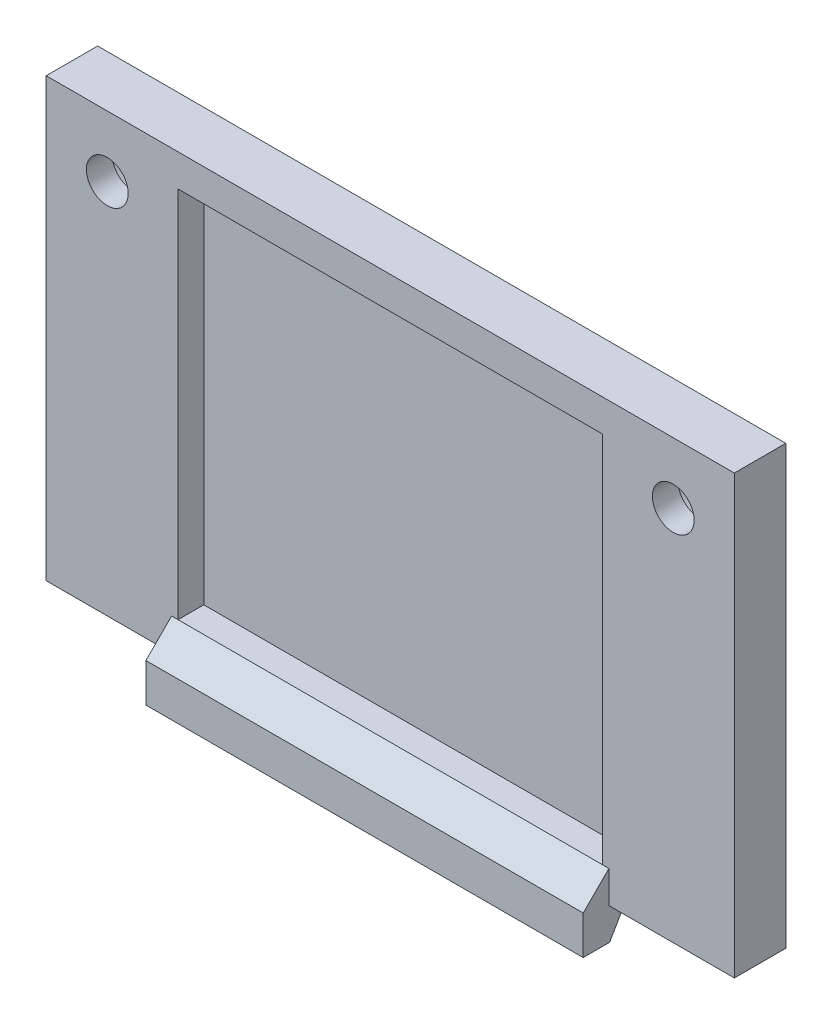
ISO-10303-21;
HEADER;
FILE_DESCRIPTION(('STEP AP214'),'2;1');
FILE_NAME('part.step','',(''),(''),'','','');
FILE_SCHEMA(('AUTOMOTIVE_DESIGN { 1 0 10303 214 1 1 1 1 }'));
ENDSEC;
DATA;
#1=APPLICATION_CONTEXT('core data for automotive mechanical design processes');
#2=APPLICATION_PROTOCOL_DEFINITION('international standard','automotive_design',2000,#1);
#3=PRODUCT_CONTEXT('',#1,'mechanical');
#4=PRODUCT('Part','Part','',(#3));
#5=PRODUCT_RELATED_PRODUCT_CATEGORY('part','',(#4));
#6=PRODUCT_DEFINITION_FORMATION('','',#4);
#7=PRODUCT_DEFINITION_CONTEXT('part definition',#1,'design');
#8=PRODUCT_DEFINITION('design','',#6,#7);
#9=PRODUCT_DEFINITION_SHAPE('','',#8);
#10=(LENGTH_UNIT() NAMED_UNIT(*) SI_UNIT(.MILLI.,.METRE.));
#11=(NAMED_UNIT(*) PLANE_ANGLE_UNIT() SI_UNIT($,.RADIAN.));
#12=(NAMED_UNIT(*) SI_UNIT($,.STERADIAN.) SOLID_ANGLE_UNIT());
#13=UNCERTAINTY_MEASURE_WITH_UNIT(LENGTH_MEASURE(1.E-05),#10,'distance_accuracy_value','');
#14=(GEOMETRIC_REPRESENTATION_CONTEXT(3) GLOBAL_UNCERTAINTY_ASSIGNED_CONTEXT((#13)) GLOBAL_UNIT_ASSIGNED_CONTEXT((#10,
#11,#12)) REPRESENTATION_CONTEXT('',''));
#15=CARTESIAN_POINT('',(0.,0.,0.));
#16=DIRECTION('',(0.,0.,1.));
#17=DIRECTION('',(1.,0.,0.));
#18=AXIS2_PLACEMENT_3D('',#15,#16,#17);
#19=CARTESIAN_POINT('',(0.,0.,0.));
#20=DIRECTION('',(0.,0.,1.));
#21=DIRECTION('',(1.,0.,0.));
#22=AXIS2_PLACEMENT_3D('',#19,#20,#21);
#23=PLANE('',#22);
#24=DIRECTION('',(0.,-1.,0.));
#25=VECTOR('',#24,1.);
#26=CARTESIAN_POINT('',(-26.75,-17.,0.));
#27=LINE('',#26,#25);
#28=CARTESIAN_POINT('',(-26.75,17.,0.));
#29=VERTEX_POINT('',#28);
#30=CARTESIAN_POINT('',(-26.75,-17.,0.));
#31=VERTEX_POINT('',#30);
#32=EDGE_CURVE('E241',#29,#31,#27,.T.);
#33=ORIENTED_EDGE('',*,*,#32,.F.);
#34=DIRECTION('',(-1.,0.,0.));
#35=VECTOR('',#34,1.);
#36=CARTESIAN_POINT('',(26.75,17.,0.));
#37=LINE('',#36,#35);
#38=CARTESIAN_POINT('',(26.75,17.,0.));
#39=VERTEX_POINT('',#38);
#40=EDGE_CURVE('E248',#39,#29,#37,.T.);
#41=ORIENTED_EDGE('',*,*,#40,.F.);
#42=DIRECTION('',(0.,1.,0.));
#43=VECTOR('',#42,1.);
#44=CARTESIAN_POINT('',(26.75,-17.,0.));
#45=LINE('',#44,#43);
#46=CARTESIAN_POINT('',(26.75,-17.,0.));
#47=VERTEX_POINT('',#46);
#48=EDGE_CURVE('E246',#47,#39,#45,.T.);
#49=ORIENTED_EDGE('',*,*,#48,.F.);
#50=DIRECTION('',(1.,0.,0.));
#51=VECTOR('',#50,1.);
#52=CARTESIAN_POINT('',(26.75,-17.,0.));
#53=LINE('',#52,#51);
#54=EDGE_CURVE('E244',#31,#47,#53,.T.);
#55=ORIENTED_EDGE('',*,*,#54,.F.);
#56=EDGE_LOOP('',(#33,#41,#49,#55));
#57=FACE_BOUND('',#56,.T.);
#58=CARTESIAN_POINT('',(-22.,12.25,0.));
#59=DIRECTION('',(0.,0.,1.));
#60=DIRECTION('',(1.,0.,0.));
#61=AXIS2_PLACEMENT_3D('',#58,#59,#60);
#62=CIRCLE('',#61,3.25);
#63=CARTESIAN_POINT('',(-18.75,12.25,0.));
#64=VERTEX_POINT('',#63);
#65=EDGE_CURVE('E236',#64,#64,#62,.T.);
#66=ORIENTED_EDGE('',*,*,#65,.T.);
#67=EDGE_LOOP('',(#66));
#68=FACE_BOUND('',#67,.T.);
#69=CARTESIAN_POINT('',(22.,12.25,0.));
#70=DIRECTION('',(0.,0.,1.));
#71=DIRECTION('',(1.,0.,0.));
#72=AXIS2_PLACEMENT_3D('',#69,#70,#71);
#73=CIRCLE('',#72,3.25);
#74=CARTESIAN_POINT('',(25.25,12.25,0.));
#75=VERTEX_POINT('',#74);
#76=EDGE_CURVE('E233',#75,#75,#73,.T.);
#77=ORIENTED_EDGE('',*,*,#76,.T.);
#78=EDGE_LOOP('',(#77));
#79=FACE_BOUND('',#78,.T.);
#80=ADVANCED_FACE('F40',(#57,#68,#79),#23,.F.);
#81=CARTESIAN_POINT('',(-26.75,-17.,2.));
#82=DIRECTION('',(1.,0.,0.));
#83=DIRECTION('',(0.,1.,0.));
#84=AXIS2_PLACEMENT_3D('',#81,#82,#83);
#85=PLANE('',#84);
#86=ORIENTED_EDGE('',*,*,#32,.T.);
#87=DIRECTION('',(0.,0.,-1.));
#88=VECTOR('',#87,1.);
#89=CARTESIAN_POINT('',(-26.75,-17.,2.));
#90=LINE('',#89,#88);
#91=CARTESIAN_POINT('',(-26.75,-17.,4.));
#92=VERTEX_POINT('',#91);
#93=EDGE_CURVE('E195',#92,#31,#90,.T.);
#94=ORIENTED_EDGE('',*,*,#93,.F.);
#95=DIRECTION('',(0.,-1.,0.));
#96=VECTOR('',#95,1.);
#97=CARTESIAN_POINT('',(-26.75,17.,4.));
#98=LINE('',#97,#96);
#99=CARTESIAN_POINT('',(-26.75,17.,4.));
#100=VERTEX_POINT('',#99);
#101=EDGE_CURVE('E222',#100,#92,#98,.T.);
#102=ORIENTED_EDGE('',*,*,#101,.F.);
#103=DIRECTION('',(0.,0.,-1.));
#104=VECTOR('',#103,1.);
#105=CARTESIAN_POINT('',(-26.75,17.,2.));
#106=LINE('',#105,#104);
#107=EDGE_CURVE('E250',#100,#29,#106,.T.);
#108=ORIENTED_EDGE('',*,*,#107,.T.);
#109=EDGE_LOOP('',(#86,#94,#102,#108));
#110=FACE_BOUND('',#109,.T.);
#111=ADVANCED_FACE('F314',(#110),#85,.F.);
#112=CARTESIAN_POINT('',(26.75,-17.,2.));
#113=DIRECTION('',(0.,1.,0.));
#114=DIRECTION('',(0.,0.,1.));
#115=AXIS2_PLACEMENT_3D('',#112,#113,#114);
#116=PLANE('',#115);
#117=DIRECTION('',(1.,0.,0.));
#118=VECTOR('',#117,1.);
#119=CARTESIAN_POINT('',(-26.75,-17.,4.));
#120=LINE('',#119,#118);
#121=CARTESIAN_POINT('',(17.,-17.,4.));
#122=VERTEX_POINT('',#121);
#123=CARTESIAN_POINT('',(26.75,-17.,4.));
#124=VERTEX_POINT('',#123);
#125=EDGE_CURVE('E225',#122,#124,#120,.T.);
#126=ORIENTED_EDGE('',*,*,#125,.F.);
#127=DIRECTION('',(0.,0.,-1.));
#128=VECTOR('',#127,1.);
#129=CARTESIAN_POINT('',(17.,-17.,6.));
#130=LINE('',#129,#128);
#131=CARTESIAN_POINT('',(17.,-17.,2.49999999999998));
#132=VERTEX_POINT('',#131);
#133=EDGE_CURVE('E265',#122,#132,#130,.T.);
#134=ORIENTED_EDGE('',*,*,#133,.T.);
#135=DIRECTION('',(-1.,0.,0.));
#136=VECTOR('',#135,1.);
#137=CARTESIAN_POINT('',(26.75,-17.,2.49999999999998));
#138=LINE('',#137,#136);
#139=CARTESIAN_POINT('',(-17.,-17.,2.49999999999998));
#140=VERTEX_POINT('',#139);
#141=EDGE_CURVE('E262',#132,#140,#138,.T.);
#142=ORIENTED_EDGE('',*,*,#141,.T.);
#143=DIRECTION('',(0.,0.,1.));
#144=VECTOR('',#143,1.);
#145=CARTESIAN_POINT('',(-17.,-17.,6.));
#146=LINE('',#145,#144);
#147=CARTESIAN_POINT('',(-17.,-17.,4.));
#148=VERTEX_POINT('',#147);
#149=EDGE_CURVE('E194',#140,#148,#146,.T.);
#150=ORIENTED_EDGE('',*,*,#149,.T.);
#151=EDGE_CURVE('E226',#92,#148,#120,.T.);
#152=ORIENTED_EDGE('',*,*,#151,.F.);
#153=ORIENTED_EDGE('',*,*,#93,.T.);
#154=ORIENTED_EDGE('',*,*,#54,.T.);
#155=DIRECTION('',(0.,0.,-1.));
#156=VECTOR('',#155,1.);
#157=CARTESIAN_POINT('',(26.75,-17.,2.));
#158=LINE('',#157,#156);
#159=EDGE_CURVE('E256',#124,#47,#158,.T.);
#160=ORIENTED_EDGE('',*,*,#159,.F.);
#161=EDGE_LOOP('',(#126,#134,#142,#150,#152,#153,#154,#160));
#162=FACE_BOUND('',#161,.T.);
#163=ADVANCED_FACE('F320',(#162),#116,.F.);
#164=CARTESIAN_POINT('',(26.75,-17.,2.));
#165=DIRECTION('',(-1.,0.,0.));
#166=DIRECTION('',(0.,0.,1.));
#167=AXIS2_PLACEMENT_3D('',#164,#165,#166);
#168=PLANE('',#167);
#169=ORIENTED_EDGE('',*,*,#48,.T.);
#170=DIRECTION('',(0.,0.,-1.));
#171=VECTOR('',#170,1.);
#172=CARTESIAN_POINT('',(26.75,17.,2.));
#173=LINE('',#172,#171);
#174=CARTESIAN_POINT('',(26.75,17.,4.));
#175=VERTEX_POINT('',#174);
#176=EDGE_CURVE('E253',#175,#39,#173,.T.);
#177=ORIENTED_EDGE('',*,*,#176,.F.);
#178=DIRECTION('',(0.,1.,0.));
#179=VECTOR('',#178,1.);
#180=CARTESIAN_POINT('',(26.75,17.,4.));
#181=LINE('',#180,#179);
#182=EDGE_CURVE('E214',#124,#175,#181,.T.);
#183=ORIENTED_EDGE('',*,*,#182,.F.);
#184=ORIENTED_EDGE('',*,*,#159,.T.);
#185=EDGE_LOOP('',(#169,#177,#183,#184));
#186=FACE_BOUND('',#185,.T.);
#187=ADVANCED_FACE('F332',(#186),#168,.F.);
#188=CARTESIAN_POINT('',(26.75,17.,2.));
#189=DIRECTION('',(0.,-1.,0.));
#190=DIRECTION('',(0.,0.,-1.));
#191=AXIS2_PLACEMENT_3D('',#188,#189,#190);
#192=PLANE('',#191);
#193=ORIENTED_EDGE('',*,*,#40,.T.);
#194=ORIENTED_EDGE('',*,*,#107,.F.);
#195=DIRECTION('',(-1.,0.,0.));
#196=VECTOR('',#195,1.);
#197=CARTESIAN_POINT('',(-26.75,17.,4.));
#198=LINE('',#197,#196);
#199=EDGE_CURVE('E219',#175,#100,#198,.T.);
#200=ORIENTED_EDGE('',*,*,#199,.F.);
#201=ORIENTED_EDGE('',*,*,#176,.T.);
#202=EDGE_LOOP('',(#193,#194,#200,#201));
#203=FACE_BOUND('',#202,.T.);
#204=ADVANCED_FACE('F329',(#203),#192,.F.);
#205=CARTESIAN_POINT('',(-22.,12.25,2.));
#206=DIRECTION('',(0.,0.,-1.));
#207=DIRECTION('',(-1.,0.,0.));
#208=AXIS2_PLACEMENT_3D('',#205,#206,#207);
#209=CYLINDRICAL_SURFACE('',#208,3.25);
#210=CARTESIAN_POINT('',(-22.,12.25,2.));
#211=DIRECTION('',(0.,0.,1.));
#212=DIRECTION('',(1.,0.,0.));
#213=AXIS2_PLACEMENT_3D('',#210,#211,#212);
#214=CIRCLE('',#213,3.25);
#215=CARTESIAN_POINT('',(-18.75,12.25,2.));
#216=VERTEX_POINT('',#215);
#217=EDGE_CURVE('E232',#216,#216,#214,.T.);
#218=ORIENTED_EDGE('',*,*,#217,.T.);
#219=EDGE_LOOP('',(#218));
#220=FACE_BOUND('',#219,.T.);
#221=ORIENTED_EDGE('',*,*,#65,.F.);
#222=EDGE_LOOP('',(#221));
#223=FACE_BOUND('',#222,.T.);
#224=ADVANCED_FACE('F327',(#220,#223),#209,.F.);
#225=CARTESIAN_POINT('',(22.,12.25,2.));
#226=DIRECTION('',(0.,0.,-1.));
#227=DIRECTION('',(-1.,0.,0.));
#228=AXIS2_PLACEMENT_3D('',#225,#226,#227);
#229=CYLINDRICAL_SURFACE('',#228,3.25);
#230=CARTESIAN_POINT('',(22.,12.25,2.));
#231=DIRECTION('',(0.,0.,1.));
#232=DIRECTION('',(1.,0.,0.));
#233=AXIS2_PLACEMENT_3D('',#230,#231,#232);
#234=CIRCLE('',#233,3.25);
#235=CARTESIAN_POINT('',(25.25,12.25,2.));
#236=VERTEX_POINT('',#235);
#237=EDGE_CURVE('E229',#236,#236,#234,.T.);
#238=ORIENTED_EDGE('',*,*,#237,.T.);
#239=EDGE_LOOP('',(#238));
#240=FACE_BOUND('',#239,.T.);
#241=ORIENTED_EDGE('',*,*,#76,.F.);
#242=EDGE_LOOP('',(#241));
#243=FACE_BOUND('',#242,.T.);
#244=ADVANCED_FACE('F479',(#240,#243),#229,.F.);
#245=CARTESIAN_POINT('',(0.,0.,2.));
#246=DIRECTION('',(0.,0.,1.));
#247=DIRECTION('',(1.,0.,0.));
#248=AXIS2_PLACEMENT_3D('',#245,#246,#247);
#249=PLANE('',#248);
#250=CARTESIAN_POINT('',(-22.,12.25,2.));
#251=DIRECTION('',(0.,0.,1.));
#252=DIRECTION('',(1.,0.,0.));
#253=AXIS2_PLACEMENT_3D('',#250,#251,#252);
#254=CIRCLE('',#253,1.625);
#255=CARTESIAN_POINT('',(-20.375,12.25,2.));
#256=VERTEX_POINT('',#255);
#257=EDGE_CURVE('E204',#256,#256,#254,.T.);
#258=ORIENTED_EDGE('',*,*,#257,.T.);
#259=EDGE_LOOP('',(#258));
#260=FACE_BOUND('',#259,.T.);
#261=ORIENTED_EDGE('',*,*,#217,.F.);
#262=EDGE_LOOP('',(#261));
#263=FACE_BOUND('',#262,.T.);
#264=ADVANCED_FACE('F469',(#260,#263),#249,.F.);
#265=CARTESIAN_POINT('',(22.,12.25,2.));
#266=DIRECTION('',(0.,0.,1.));
#267=DIRECTION('',(1.,0.,0.));
#268=AXIS2_PLACEMENT_3D('',#265,#266,#267);
#269=CIRCLE('',#268,1.625);
#270=CARTESIAN_POINT('',(23.625,12.25,2.));
#271=VERTEX_POINT('',#270);
#272=EDGE_CURVE('E208',#271,#271,#269,.T.);
#273=ORIENTED_EDGE('',*,*,#272,.T.);
#274=EDGE_LOOP('',(#273));
#275=FACE_BOUND('',#274,.T.);
#276=ORIENTED_EDGE('',*,*,#237,.F.);
#277=EDGE_LOOP('',(#276));
#278=FACE_BOUND('',#277,.T.);
#279=ADVANCED_FACE('F416',(#275,#278),#249,.F.);
#280=CARTESIAN_POINT('',(0.,0.,4.));
#281=DIRECTION('',(0.,0.,1.));
#282=DIRECTION('',(1.,0.,0.));
#283=AXIS2_PLACEMENT_3D('',#280,#281,#282);
#284=PLANE('',#283);
#285=DIRECTION('',(0.,-1.,0.));
#286=VECTOR('',#285,1.);
#287=CARTESIAN_POINT('',(-16.5,-14.5,4.));
#288=LINE('',#287,#286);
#289=CARTESIAN_POINT('',(-16.5,14.5,4.));
#290=VERTEX_POINT('',#289);
#291=CARTESIAN_POINT('',(-16.5,-14.5,4.));
#292=VERTEX_POINT('',#291);
#293=EDGE_CURVE('E150',#290,#292,#288,.T.);
#294=ORIENTED_EDGE('',*,*,#293,.F.);
#295=DIRECTION('',(-1.,0.,0.));
#296=VECTOR('',#295,1.);
#297=CARTESIAN_POINT('',(16.5,14.5,4.));
#298=LINE('',#297,#296);
#299=CARTESIAN_POINT('',(16.5,14.5,4.));
#300=VERTEX_POINT('',#299);
#301=EDGE_CURVE('E167',#300,#290,#298,.T.);
#302=ORIENTED_EDGE('',*,*,#301,.F.);
#303=DIRECTION('',(0.,1.,0.));
#304=VECTOR('',#303,1.);
#305=CARTESIAN_POINT('',(16.5,-14.5,4.));
#306=LINE('',#305,#304);
#307=CARTESIAN_POINT('',(16.5,-14.5,4.));
#308=VERTEX_POINT('',#307);
#309=EDGE_CURVE('E170',#308,#300,#306,.T.);
#310=ORIENTED_EDGE('',*,*,#309,.F.);
#311=DIRECTION('',(-1.,0.,0.));
#312=VECTOR('',#311,1.);
#313=CARTESIAN_POINT('',(-17.,-14.5,4.));
#314=LINE('',#313,#312);
#315=CARTESIAN_POINT('',(17.,-14.5,4.));
#316=VERTEX_POINT('',#315);
#317=EDGE_CURVE('E196',#316,#308,#314,.T.);
#318=ORIENTED_EDGE('',*,*,#317,.F.);
#319=DIRECTION('',(0.,1.,0.));
#320=VECTOR('',#319,1.);
#321=CARTESIAN_POINT('',(17.,-19.5,4.));
#322=LINE('',#321,#320);
#323=EDGE_CURVE('E192',#122,#316,#322,.T.);
#324=ORIENTED_EDGE('',*,*,#323,.F.);
#325=ORIENTED_EDGE('',*,*,#125,.T.);
#326=ORIENTED_EDGE('',*,*,#182,.T.);
#327=ORIENTED_EDGE('',*,*,#199,.T.);
#328=ORIENTED_EDGE('',*,*,#101,.T.);
#329=ORIENTED_EDGE('',*,*,#151,.T.);
#330=DIRECTION('',(0.,-1.,0.));
#331=VECTOR('',#330,1.);
#332=CARTESIAN_POINT('',(-17.,-19.5,4.));
#333=LINE('',#332,#331);
#334=CARTESIAN_POINT('',(-17.,-14.5,4.));
#335=VERTEX_POINT('',#334);
#336=EDGE_CURVE('E187',#335,#148,#333,.T.);
#337=ORIENTED_EDGE('',*,*,#336,.F.);
#338=EDGE_CURVE('E180',#292,#335,#314,.T.);
#339=ORIENTED_EDGE('',*,*,#338,.F.);
#340=EDGE_LOOP('',(#294,#302,#310,#318,#324,#325,#326,#327,#328,#329,#337,#339));
#341=FACE_BOUND('',#340,.T.);
#342=CARTESIAN_POINT('',(22.,12.25,4.));
#343=DIRECTION('',(0.,0.,1.));
#344=DIRECTION('',(1.,0.,0.));
#345=AXIS2_PLACEMENT_3D('',#342,#343,#344);
#346=CIRCLE('',#345,1.625);
#347=CARTESIAN_POINT('',(23.625,12.25,4.));
#348=VERTEX_POINT('',#347);
#349=EDGE_CURVE('E211',#348,#348,#346,.T.);
#350=ORIENTED_EDGE('',*,*,#349,.F.);
#351=EDGE_LOOP('',(#350));
#352=FACE_BOUND('',#351,.T.);
#353=CARTESIAN_POINT('',(-22.,12.25,4.));
#354=DIRECTION('',(0.,0.,1.));
#355=DIRECTION('',(1.,0.,0.));
#356=AXIS2_PLACEMENT_3D('',#353,#354,#355);
#357=CIRCLE('',#356,1.625);
#358=CARTESIAN_POINT('',(-20.375,12.25,4.));
#359=VERTEX_POINT('',#358);
#360=EDGE_CURVE('E205',#359,#359,#357,.T.);
#361=ORIENTED_EDGE('',*,*,#360,.F.);
#362=EDGE_LOOP('',(#361));
#363=FACE_BOUND('',#362,.T.);
#364=ADVANCED_FACE('F284',(#341,#352,#363),#284,.T.);
#365=CARTESIAN_POINT('',(22.,12.25,4.));
#366=DIRECTION('',(0.,0.,-1.));
#367=DIRECTION('',(-1.,0.,0.));
#368=AXIS2_PLACEMENT_3D('',#365,#366,#367);
#369=CYLINDRICAL_SURFACE('',#368,1.625);
#370=ORIENTED_EDGE('',*,*,#349,.T.);
#371=EDGE_LOOP('',(#370));
#372=FACE_BOUND('',#371,.T.);
#373=ORIENTED_EDGE('',*,*,#272,.F.);
#374=EDGE_LOOP('',(#373));
#375=FACE_BOUND('',#374,.T.);
#376=ADVANCED_FACE('F310',(#372,#375),#369,.F.);
#377=CARTESIAN_POINT('',(-22.,12.25,4.));
#378=DIRECTION('',(0.,0.,-1.));
#379=DIRECTION('',(-1.,0.,0.));
#380=AXIS2_PLACEMENT_3D('',#377,#378,#379);
#381=CYLINDRICAL_SURFACE('',#380,1.625);
#382=ORIENTED_EDGE('',*,*,#360,.T.);
#383=EDGE_LOOP('',(#382));
#384=FACE_BOUND('',#383,.T.);
#385=ORIENTED_EDGE('',*,*,#257,.F.);
#386=EDGE_LOOP('',(#385));
#387=FACE_BOUND('',#386,.T.);
#388=ADVANCED_FACE('F303',(#384,#387),#381,.F.);
#389=CARTESIAN_POINT('',(17.,-19.5,6.));
#390=DIRECTION('',(-1.,0.,0.));
#391=DIRECTION('',(0.,0.,1.));
#392=AXIS2_PLACEMENT_3D('',#389,#390,#391);
#393=PLANE('',#392);
#394=ORIENTED_EDGE('',*,*,#323,.T.);
#395=DIRECTION('',(0.,0.707106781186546,-0.707106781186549));
#396=VECTOR('',#395,1.);
#397=CARTESIAN_POINT('',(17.,-16.5,6.));
#398=LINE('',#397,#396);
#399=CARTESIAN_POINT('',(17.,-16.5,6.));
#400=VERTEX_POINT('',#399);
#401=EDGE_CURVE('E11',#316,#400,#398,.F.);
#402=ORIENTED_EDGE('',*,*,#401,.T.);
#403=DIRECTION('',(0.,1.,0.));
#404=VECTOR('',#403,1.);
#405=CARTESIAN_POINT('',(17.,-19.5,6.));
#406=LINE('',#405,#404);
#407=CARTESIAN_POINT('',(17.,-19.5,6.));
#408=VERTEX_POINT('',#407);
#409=EDGE_CURVE('E184',#408,#400,#406,.T.);
#410=ORIENTED_EDGE('',*,*,#409,.F.);
#411=DIRECTION('',(0.,0.,-1.));
#412=VECTOR('',#411,1.);
#413=CARTESIAN_POINT('',(17.,-19.5,6.));
#414=LINE('',#413,#412);
#415=CARTESIAN_POINT('',(17.,-19.5,3.94337567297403));
#416=VERTEX_POINT('',#415);
#417=EDGE_CURVE('E191',#408,#416,#414,.T.);
#418=ORIENTED_EDGE('',*,*,#417,.T.);
#419=DIRECTION('',(0.,0.866025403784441,-0.499999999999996));
#420=VECTOR('',#419,1.);
#421=CARTESIAN_POINT('',(17.,-20.3905444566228,4.45753175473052));
#422=LINE('',#421,#420);
#423=EDGE_CURVE('E271',#416,#132,#422,.T.);
#424=ORIENTED_EDGE('',*,*,#423,.T.);
#425=ORIENTED_EDGE('',*,*,#133,.F.);
#426=EDGE_LOOP('',(#394,#402,#410,#418,#424,#425));
#427=FACE_BOUND('',#426,.T.);
#428=ADVANCED_FACE('F301',(#427),#393,.F.);
#429=CARTESIAN_POINT('',(-17.,-14.5,6.));
#430=DIRECTION('',(0.,-1.,0.));
#431=DIRECTION('',(0.,0.,-1.));
#432=AXIS2_PLACEMENT_3D('',#429,#430,#431);
#433=PLANE('',#432);
#434=DIRECTION('',(0.,0.,1.));
#435=VECTOR('',#434,1.);
#436=CARTESIAN_POINT('',(-16.5,-14.5,2.));
#437=LINE('',#436,#435);
#438=CARTESIAN_POINT('',(-16.5,-14.5,2.));
#439=VERTEX_POINT('',#438);
#440=EDGE_CURVE('E143',#439,#292,#437,.T.);
#441=ORIENTED_EDGE('',*,*,#440,.T.);
#442=DIRECTION('',(1.,0.,0.));
#443=VECTOR('',#442,1.);
#444=CARTESIAN_POINT('',(-17.,-14.5,4.));
#445=LINE('',#444,#443);
#446=EDGE_CURVE('E49',#292,#308,#445,.T.);
#447=ORIENTED_EDGE('',*,*,#446,.T.);
#448=DIRECTION('',(0.,0.,1.));
#449=VECTOR('',#448,1.);
#450=CARTESIAN_POINT('',(16.5,-14.5,2.));
#451=LINE('',#450,#449);
#452=CARTESIAN_POINT('',(16.5,-14.5,2.));
#453=VERTEX_POINT('',#452);
#454=EDGE_CURVE('E153',#453,#308,#451,.T.);
#455=ORIENTED_EDGE('',*,*,#454,.F.);
#456=DIRECTION('',(1.,0.,0.));
#457=VECTOR('',#456,1.);
#458=CARTESIAN_POINT('',(16.5,-14.5,2.));
#459=LINE('',#458,#457);
#460=EDGE_CURVE('E157',#439,#453,#459,.T.);
#461=ORIENTED_EDGE('',*,*,#460,.F.);
#462=EDGE_LOOP('',(#441,#447,#455,#461));
#463=FACE_BOUND('',#462,.T.);
#464=ADVANCED_FACE('F158',(#463),#433,.F.);
#465=CARTESIAN_POINT('',(-17.,-19.5,6.));
#466=DIRECTION('',(1.,0.,0.));
#467=DIRECTION('',(0.,0.,-1.));
#468=AXIS2_PLACEMENT_3D('',#465,#466,#467);
#469=PLANE('',#468);
#470=DIRECTION('',(0.,-1.,0.));
#471=VECTOR('',#470,1.);
#472=CARTESIAN_POINT('',(-17.,-19.5,6.));
#473=LINE('',#472,#471);
#474=CARTESIAN_POINT('',(-17.,-16.5,6.));
#475=VERTEX_POINT('',#474);
#476=CARTESIAN_POINT('',(-17.,-19.5,6.));
#477=VERTEX_POINT('',#476);
#478=EDGE_CURVE('E186',#475,#477,#473,.T.);
#479=ORIENTED_EDGE('',*,*,#478,.F.);
#480=DIRECTION('',(0.,-0.707106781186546,0.707106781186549));
#481=VECTOR('',#480,1.);
#482=CARTESIAN_POINT('',(-17.,-16.5,6.));
#483=LINE('',#482,#481);
#484=EDGE_CURVE('E56',#475,#335,#483,.F.);
#485=ORIENTED_EDGE('',*,*,#484,.T.);
#486=ORIENTED_EDGE('',*,*,#336,.T.);
#487=ORIENTED_EDGE('',*,*,#149,.F.);
#488=DIRECTION('',(0.,-0.866025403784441,0.499999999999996));
#489=VECTOR('',#488,1.);
#490=CARTESIAN_POINT('',(-17.,-20.3905444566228,4.45753175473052));
#491=LINE('',#490,#489);
#492=CARTESIAN_POINT('',(-17.,-19.5,3.94337567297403));
#493=VERTEX_POINT('',#492);
#494=EDGE_CURVE('E273',#140,#493,#491,.T.);
#495=ORIENTED_EDGE('',*,*,#494,.T.);
#496=DIRECTION('',(0.,0.,-1.));
#497=VECTOR('',#496,1.);
#498=CARTESIAN_POINT('',(-17.,-19.5,6.));
#499=LINE('',#498,#497);
#500=EDGE_CURVE('E202',#477,#493,#499,.T.);
#501=ORIENTED_EDGE('',*,*,#500,.F.);
#502=EDGE_LOOP('',(#479,#485,#486,#487,#495,#501));
#503=FACE_BOUND('',#502,.T.);
#504=ADVANCED_FACE('F292',(#503),#469,.F.);
#505=CARTESIAN_POINT('',(-17.,-19.5,6.));
#506=DIRECTION('',(0.,1.,0.));
#507=DIRECTION('',(0.,0.,1.));
#508=AXIS2_PLACEMENT_3D('',#505,#506,#507);
#509=PLANE('',#508);
#510=ORIENTED_EDGE('',*,*,#500,.T.);
#511=DIRECTION('',(1.,0.,0.));
#512=VECTOR('',#511,1.);
#513=CARTESIAN_POINT('',(-17.,-19.5,3.94337567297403));
#514=LINE('',#513,#512);
#515=EDGE_CURVE('E268',#493,#416,#514,.T.);
#516=ORIENTED_EDGE('',*,*,#515,.T.);
#517=ORIENTED_EDGE('',*,*,#417,.F.);
#518=DIRECTION('',(1.,0.,0.));
#519=VECTOR('',#518,1.);
#520=CARTESIAN_POINT('',(-17.,-19.5,6.));
#521=LINE('',#520,#519);
#522=EDGE_CURVE('E189',#477,#408,#521,.T.);
#523=ORIENTED_EDGE('',*,*,#522,.F.);
#524=EDGE_LOOP('',(#510,#516,#517,#523));
#525=FACE_BOUND('',#524,.T.);
#526=ADVANCED_FACE('F299',(#525),#509,.F.);
#527=CARTESIAN_POINT('',(0.,0.,6.));
#528=DIRECTION('',(0.,0.,-1.));
#529=DIRECTION('',(-1.,0.,0.));
#530=AXIS2_PLACEMENT_3D('',#527,#528,#529);
#531=PLANE('',#530);
#532=ORIENTED_EDGE('',*,*,#409,.T.);
#533=DIRECTION('',(-1.,0.,0.));
#534=VECTOR('',#533,1.);
#535=CARTESIAN_POINT('',(0.,-16.5,6.));
#536=LINE('',#535,#534);
#537=EDGE_CURVE('E276',#400,#475,#536,.T.);
#538=ORIENTED_EDGE('',*,*,#537,.T.);
#539=ORIENTED_EDGE('',*,*,#478,.T.);
#540=ORIENTED_EDGE('',*,*,#522,.T.);
#541=EDGE_LOOP('',(#532,#538,#539,#540));
#542=FACE_BOUND('',#541,.T.);
#543=ADVANCED_FACE('F289',(#542),#531,.F.);
#544=CARTESIAN_POINT('',(0.,-19.5980762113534,4.));
#545=DIRECTION('',(0.,0.499999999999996,0.866025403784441));
#546=DIRECTION('',(1.,0.,0.));
#547=AXIS2_PLACEMENT_3D('',#544,#545,#546);
#548=PLANE('',#547);
#549=ORIENTED_EDGE('',*,*,#494,.F.);
#550=ORIENTED_EDGE('',*,*,#141,.F.);
#551=ORIENTED_EDGE('',*,*,#423,.F.);
#552=ORIENTED_EDGE('',*,*,#515,.F.);
#553=EDGE_LOOP('',(#549,#550,#551,#552));
#554=FACE_BOUND('',#553,.T.);
#555=ADVANCED_FACE('F340',(#554),#548,.F.);
#556=CARTESIAN_POINT('',(-16.5,-14.5,2.));
#557=DIRECTION('',(-1.,0.,0.));
#558=DIRECTION('',(0.,0.,1.));
#559=AXIS2_PLACEMENT_3D('',#556,#557,#558);
#560=PLANE('',#559);
#561=ORIENTED_EDGE('',*,*,#293,.T.);
#562=ORIENTED_EDGE('',*,*,#440,.F.);
#563=DIRECTION('',(0.,-1.,0.));
#564=VECTOR('',#563,1.);
#565=CARTESIAN_POINT('',(-16.5,-14.5,2.));
#566=LINE('',#565,#564);
#567=CARTESIAN_POINT('',(-16.5,14.5,2.));
#568=VERTEX_POINT('',#567);
#569=EDGE_CURVE('E147',#568,#439,#566,.T.);
#570=ORIENTED_EDGE('',*,*,#569,.F.);
#571=DIRECTION('',(0.,0.,1.));
#572=VECTOR('',#571,1.);
#573=CARTESIAN_POINT('',(-16.5,14.5,2.));
#574=LINE('',#573,#572);
#575=EDGE_CURVE('E178',#568,#290,#574,.T.);
#576=ORIENTED_EDGE('',*,*,#575,.T.);
#577=EDGE_LOOP('',(#561,#562,#570,#576));
#578=FACE_BOUND('',#577,.T.);
#579=ADVANCED_FACE('F145',(#578),#560,.F.);
#580=CARTESIAN_POINT('',(16.5,14.5,2.));
#581=DIRECTION('',(0.,1.,0.));
#582=DIRECTION('',(-1.,0.,0.));
#583=AXIS2_PLACEMENT_3D('',#580,#581,#582);
#584=PLANE('',#583);
#585=ORIENTED_EDGE('',*,*,#301,.T.);
#586=ORIENTED_EDGE('',*,*,#575,.F.);
#587=DIRECTION('',(-1.,0.,0.));
#588=VECTOR('',#587,1.);
#589=CARTESIAN_POINT('',(16.5,14.5,2.));
#590=LINE('',#589,#588);
#591=CARTESIAN_POINT('',(16.5,14.5,2.));
#592=VERTEX_POINT('',#591);
#593=EDGE_CURVE('E154',#592,#568,#590,.T.);
#594=ORIENTED_EDGE('',*,*,#593,.F.);
#595=DIRECTION('',(0.,0.,1.));
#596=VECTOR('',#595,1.);
#597=CARTESIAN_POINT('',(16.5,14.5,2.));
#598=LINE('',#597,#596);
#599=EDGE_CURVE('E181',#592,#300,#598,.T.);
#600=ORIENTED_EDGE('',*,*,#599,.T.);
#601=EDGE_LOOP('',(#585,#586,#594,#600));
#602=FACE_BOUND('',#601,.T.);
#603=ADVANCED_FACE('F349',(#602),#584,.F.);
#604=CARTESIAN_POINT('',(16.5,-14.5,2.));
#605=DIRECTION('',(1.,0.,0.));
#606=DIRECTION('',(0.,0.,-1.));
#607=AXIS2_PLACEMENT_3D('',#604,#605,#606);
#608=PLANE('',#607);
#609=ORIENTED_EDGE('',*,*,#309,.T.);
#610=ORIENTED_EDGE('',*,*,#599,.F.);
#611=DIRECTION('',(0.,1.,0.));
#612=VECTOR('',#611,1.);
#613=CARTESIAN_POINT('',(16.5,-14.5,2.));
#614=LINE('',#613,#612);
#615=EDGE_CURVE('E163',#453,#592,#614,.T.);
#616=ORIENTED_EDGE('',*,*,#615,.F.);
#617=ORIENTED_EDGE('',*,*,#454,.T.);
#618=EDGE_LOOP('',(#609,#610,#616,#617));
#619=FACE_BOUND('',#618,.T.);
#620=ADVANCED_FACE('F281',(#619),#608,.F.);
#621=CARTESIAN_POINT('',(0.,0.,2.));
#622=DIRECTION('',(0.,0.,1.));
#623=DIRECTION('',(1.,0.,0.));
#624=AXIS2_PLACEMENT_3D('',#621,#622,#623);
#625=PLANE('',#624);
#626=ORIENTED_EDGE('',*,*,#569,.T.);
#627=ORIENTED_EDGE('',*,*,#460,.T.);
#628=ORIENTED_EDGE('',*,*,#615,.T.);
#629=ORIENTED_EDGE('',*,*,#593,.T.);
#630=EDGE_LOOP('',(#626,#627,#628,#629));
#631=FACE_BOUND('',#630,.T.);
#632=ADVANCED_FACE('F165',(#631),#625,.T.);
#633=CARTESIAN_POINT('',(0.,-16.5,6.));
#634=DIRECTION('',(0.,-0.707106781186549,-0.707106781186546));
#635=DIRECTION('',(-1.,0.,0.));
#636=AXIS2_PLACEMENT_3D('',#633,#634,#635);
#637=PLANE('',#636);
#638=ORIENTED_EDGE('',*,*,#446,.F.);
#639=ORIENTED_EDGE('',*,*,#338,.T.);
#640=ORIENTED_EDGE('',*,*,#484,.F.);
#641=ORIENTED_EDGE('',*,*,#537,.F.);
#642=ORIENTED_EDGE('',*,*,#401,.F.);
#643=ORIENTED_EDGE('',*,*,#317,.T.);
#644=EDGE_LOOP('',(#638,#639,#640,#641,#642,#643));
#645=FACE_BOUND('',#644,.T.);
#646=ADVANCED_FACE('F43',(#645),#637,.F.);
#647=CLOSED_SHELL('',(#80,#111,#163,#187,#204,#224,#244,#264,#279,#364,#376,#388,#428,#464,#504,
#526,#543,#555,#579,#603,#620,#632,#646));
#648=MANIFOLD_SOLID_BREP('B2',#647);
#649=ADVANCED_BREP_SHAPE_REPRESENTATION('',(#18,#648),#14);
#650=SHAPE_DEFINITION_REPRESENTATION(#9,#649);
ENDSEC;
END-ISO-10303-21;
